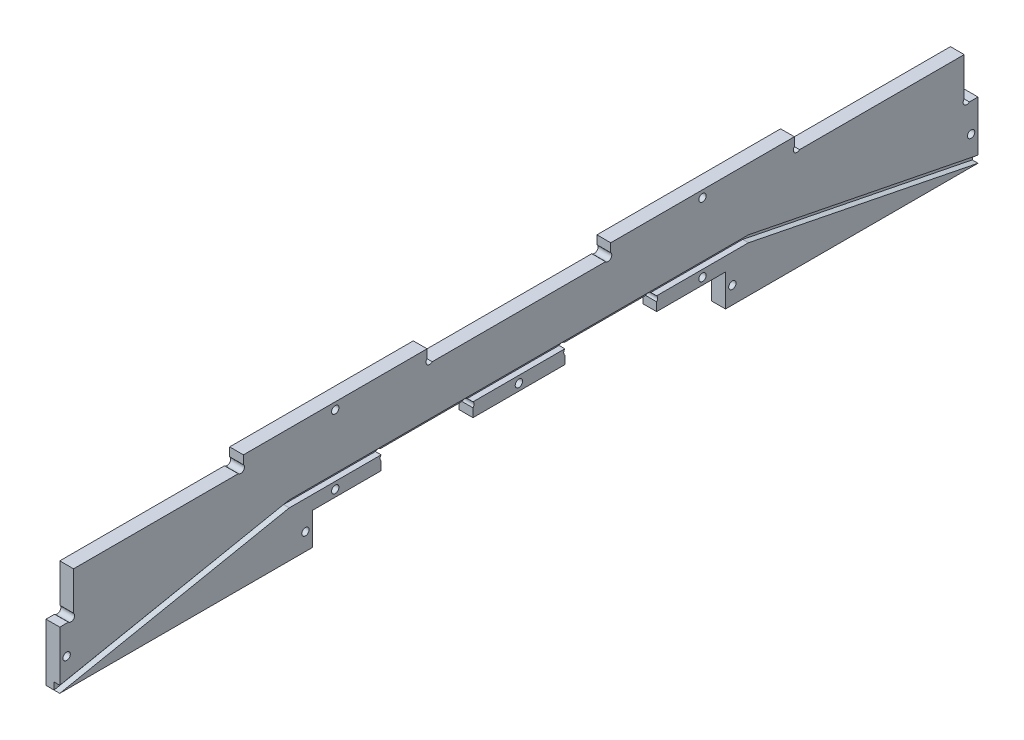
from build123d import *

# Parameters (mm, degrees)
ESQUISSE1_R             = 1.6
BOSS_EXTRU_1_DEPTH      = 6
ENL_V_MAT_EXTRU_1_DEPTH = 2.5


with BuildPart() as part:
    # Esquisse1 → Boss.-Extru.1 (new body)
    with BuildSketch(Plane(origin=(0, 0, 0), x_dir=(0, 0, -1), z_dir=(1, 0, 0))):
        with BuildLine():
            Line((40, 46.2627417), (40, 50))
            Line((40, 50), (120, 50))
            Line((120, 50), (120, 46.2627417))
            ThreePointArc((120, 46.2627417), (120, 44), (122.2627417, 44))
            Line((122.2627417, 44), (194, 44))
            Line((194, 44), (194, 27.2627417))
            ThreePointArc((194, 27.2627417), (194, 25), (196.2627417, 25))
            Line((196.2627417, 25), (200, 25))
            Line((200, 25), (200, 0))
            Line((200, 0), (90, 0))
            Line((90, 0), (90, 14))
            Line((90, 14), (60, 14))
            Line((60, 14), (60, 17.7372583))
            ThreePointArc((60, 17.7372583), (60, 20), (57.7372583, 20))
            Line((57.7372583, 20), (22.2627417, 20))
            ThreePointArc((22.2627417, 20), (20, 20), (20, 17.7372583))
            Line((20, 17.7372583), (20, 14))
            Line((20, 14), (-20, 14))
            Line((-20, 14), (-20, 17.7372583))
            ThreePointArc((-20, 17.7372583), (-20, 20), (-22.2627417, 20))
            Line((-22.2627417, 20), (-57.7372583, 20))
            ThreePointArc((-57.7372583, 20), (-60, 20), (-60, 17.7372583))
            Line((-60, 17.7372583), (-60, 14))
            Line((-60, 14), (-90, 14))
            Line((-90, 14), (-90, 0))
            Line((-90, 0), (-200, 0))
            Line((-200, 0), (-200, 25))
            Line((-200, 25), (-196.2627417, 25))
            ThreePointArc((-196.2627417, 25), (-194, 25), (-194, 27.2627417))
            Line((-194, 27.2627417), (-194, 44))
            Line((-194, 44), (-122.2627417, 44))
            ThreePointArc((-122.2627417, 44), (-120, 44), (-120, 46.2627417))
            Line((-120, 46.2627417), (-120, 50))
            Line((-120, 50), (-40, 50))
            Line((-40, 50), (-40, 46.2627417))
            ThreePointArc((-40, 46.2627417), (-40, 44), (-37.7372583, 44))
            Line((-37.7372583, 44), (37.7372583, 44))
            ThreePointArc((37.7372583, 44), (40, 44), (40, 46.2627417))
        make_face()
        with Locations((80, 47)):
            Circle(ESQUISSE1_R, mode=Mode.SUBTRACT)
        with Locations(Location((-80, 47, 0), (0, 0, 180))):
            Circle(ESQUISSE1_R, mode=Mode.SUBTRACT)
        with Locations((197, 12.5)):
            Circle(ESQUISSE1_R, mode=Mode.SUBTRACT)
        with Locations(Location((-197, 12.5, 0), (0, 0, 180))):
            Circle(ESQUISSE1_R, mode=Mode.SUBTRACT)
        with Locations((0, 17)):
            Circle(ESQUISSE1_R, mode=Mode.SUBTRACT)
        with Locations((93, 7.5)):
            Circle(ESQUISSE1_R, mode=Mode.SUBTRACT)
        with Locations(Location((-93, 7.5, 0), (0, 0, 180))):
            Circle(ESQUISSE1_R, mode=Mode.SUBTRACT)
        with Locations(Location((80, 17, 0), (0, 0, 180))):
            Circle(ESQUISSE1_R, mode=Mode.SUBTRACT)
        with Locations((-80, 17)):
            Circle(ESQUISSE1_R, mode=Mode.SUBTRACT)
    extrude(amount=BOSS_EXTRU_1_DEPTH)

    # Esquisse2 → Enl_v. mat.-Extru.1 (cut)
    with BuildSketch(Plane(origin=(6, 0, 0), x_dir=(0, 0, -1), z_dir=(1, 0, 0))):
        Polygon((100, 20), (200, 0), (200, 3.059411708), (100, 23), (-100, 23), (-200, 3.059411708), (-200, 0), (-100, 20), align=None)
    extrude(amount=-ENL_V_MAT_EXTRU_1_DEPTH, mode=Mode.SUBTRACT)


solid = part.part
